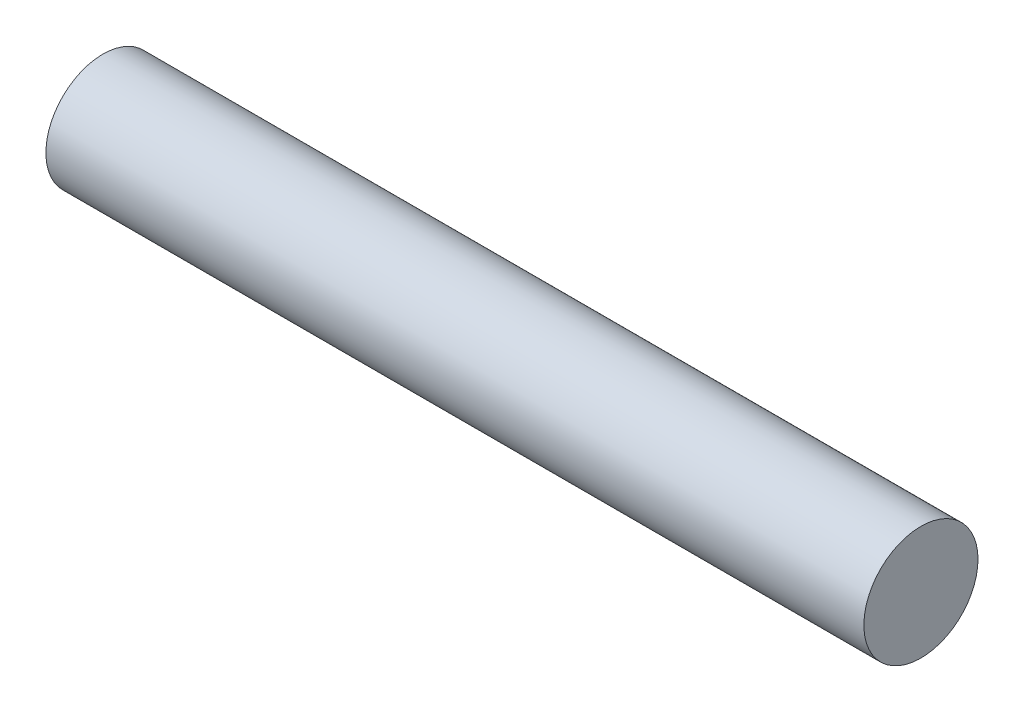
from build123d import *

# Parameters (mm, degrees)
ESQUISSE1_R      = 12
EXTRUSION1_DEPTH = 172


with BuildPart() as part:
    # Esquisse1 → Extrusion1 (new body)
    with BuildSketch(Plane(origin=(0, 0, 0), x_dir=(0, 0, -1), z_dir=(1, 0, 0))):
        Circle(ESQUISSE1_R)
    extrude(amount=EXTRUSION1_DEPTH)


solid = part.part
